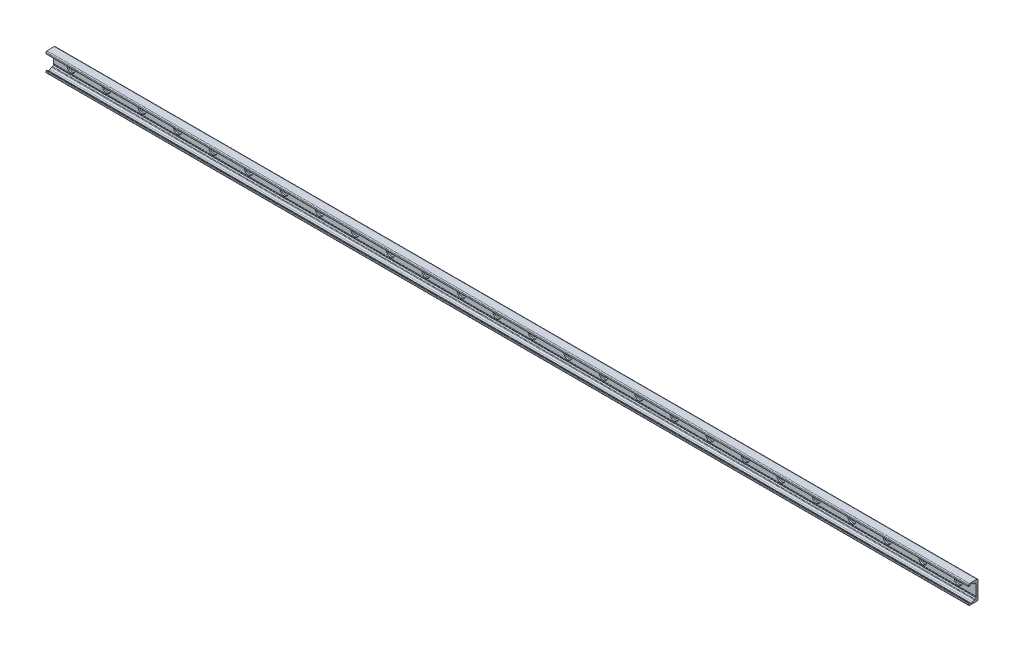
from build123d import *

# Parameters (mm, degrees)
BOSS_EXTRUDE1_DEPTH = 1040
SKETCH2_R           = 9
SKETCH2_R_2         = 4.5
CUT_EXTRUDE1_DEPTH  = 3.1
SKETCH2_2_R         = 4.5
CUT_EXTRUDE2_DEPTH  = 1041.35306507
LPATTERN1_COUNT     = 26
LPATTERN1_PITCH     = 80


with BuildPart() as part:
    # Sketch1 → Boss-Extrude1 (new, symmetric)
    with BuildSketch(Plane(origin=(0, 0, 0), x_dir=(0, 0, -1), z_dir=(1, 0, 0))):
        with BuildLine():
            Line((0, 0), (0, 19))
            ThreePointArc((0, 19), (-0.732233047, 20.767766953), (-2.5, 21.5))
            Line((-2.5, 21.5), (-19, 21.5))
            ThreePointArc((-19, 21.5), (-20.414213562, 20.914213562), (-21, 19.5))
            Line((-21, 19.5), (-21, 16.625057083))
            ThreePointArc((-21, 16.625057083), (-20.553251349, 15.888838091), (-19.693931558, 15.945160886))
            Line((-19.693931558, 15.945160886), (-16.794305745, 17.975500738))
            ThreePointArc((-16.794305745, 17.975500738), (-14.5, 18.69889256), (-12.205694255, 17.975500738))
            Line((-12.205694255, 17.975500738), (-8.829831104, 15.611695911))
            ThreePointArc((-8.829831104, 15.611695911), (-8.28408983, 15.342566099), (-7.682678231, 15.25))
            Line((-7.682678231, 15.25), (-6.5, 15.25))
            ThreePointArc((-6.5, 15.25), (-5.085786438, 14.664213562), (-4.5, 13.25))
            Line((-4.5, 13.25), (-4.5, -10.75))
            ThreePointArc((-4.5, -10.75), (-4.25, -11), (-4.5, -11.25))
            Line((-4.5, -11.25), (-4.5, -12.25))
            ThreePointArc((-4.5, -12.25), (-4.25, -12.5), (-4.5, -12.75))
            Line((-4.5, -12.75), (-4.5, -13.25))
            ThreePointArc((-4.5, -13.25), (-5.085786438, -14.664213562), (-6.5, -15.25))
            Line((-6.5, -15.25), (-7.682678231, -15.25))
            ThreePointArc((-7.682678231, -15.25), (-8.28408983, -15.342566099), (-8.829831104, -15.611695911))
            Line((-8.829831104, -15.611695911), (-12.205694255, -17.975500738))
            ThreePointArc((-12.205694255, -17.975500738), (-14.5, -18.69889256), (-16.794305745, -17.975500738))
            Line((-16.794305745, -17.975500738), (-19.693931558, -15.945160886))
            ThreePointArc((-19.693931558, -15.945160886), (-20.553251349, -15.888838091), (-21, -16.625057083))
            Line((-21, -16.625057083), (-21, -19.5))
            ThreePointArc((-21, -19.5), (-20.414213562, -20.914213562), (-19, -21.5))
            Line((-19, -21.5), (-2.5, -21.5))
            ThreePointArc((-2.5, -21.5), (-0.732233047, -20.767766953), (0, -19))
            Line((0, -19), (0, 0))
        make_face()
    extrude(amount=BOSS_EXTRUDE1_DEPTH, both=True)

    # Sketch2 → Cut-Extrude1 (cut)
    with BuildSketch(Plane.XY.offset(4.5)):
        with Locations((1000, 0)):
            Circle(SKETCH2_R)
        with Locations((1000, 0)):
            Circle(SKETCH2_R_2, mode=Mode.SUBTRACT)
    cut_extrude1 = extrude(amount=-CUT_EXTRUDE1_DEPTH, mode=Mode.SUBTRACT)

    # Sketch2_2 → Cut-Extrude2 (cut, through all)
    with BuildSketch(Plane.XY.offset(4.5)):
        with Locations((1000, 0)):
            Circle(SKETCH2_2_R)
    cut_extrude2 = extrude(amount=-CUT_EXTRUDE2_DEPTH, mode=Mode.SUBTRACT)

    # LPattern1: Cut-Extrude1, Cut-Extrude2 ×26
    with Locations(*[(-i * LPATTERN1_PITCH, 0, 0) for i in range(1, LPATTERN1_COUNT)]):
        add(cut_extrude1, mode=Mode.SUBTRACT)
        add(cut_extrude2, mode=Mode.SUBTRACT)


solid = part.part
